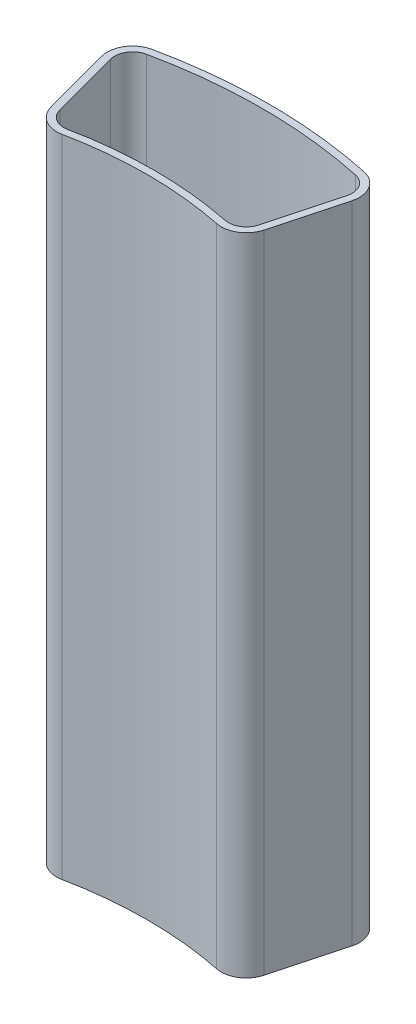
ISO-10303-21;
HEADER;
FILE_DESCRIPTION(('STEP AP214'),'2;1');
FILE_NAME('part.step','',(''),(''),'','','');
FILE_SCHEMA(('AUTOMOTIVE_DESIGN { 1 0 10303 214 1 1 1 1 }'));
ENDSEC;
DATA;
#1=APPLICATION_CONTEXT('core data for automotive mechanical design processes');
#2=APPLICATION_PROTOCOL_DEFINITION('international standard','automotive_design',2000,#1);
#3=PRODUCT_CONTEXT('',#1,'mechanical');
#4=PRODUCT('Part','Part','',(#3));
#5=PRODUCT_RELATED_PRODUCT_CATEGORY('part','',(#4));
#6=PRODUCT_DEFINITION_FORMATION('','',#4);
#7=PRODUCT_DEFINITION_CONTEXT('part definition',#1,'design');
#8=PRODUCT_DEFINITION('design','',#6,#7);
#9=PRODUCT_DEFINITION_SHAPE('','',#8);
#10=(LENGTH_UNIT() NAMED_UNIT(*) SI_UNIT(.MILLI.,.METRE.));
#11=(NAMED_UNIT(*) PLANE_ANGLE_UNIT() SI_UNIT($,.RADIAN.));
#12=(NAMED_UNIT(*) SI_UNIT($,.STERADIAN.) SOLID_ANGLE_UNIT());
#13=UNCERTAINTY_MEASURE_WITH_UNIT(LENGTH_MEASURE(1.E-05),#10,'distance_accuracy_value','');
#14=(GEOMETRIC_REPRESENTATION_CONTEXT(3) GLOBAL_UNCERTAINTY_ASSIGNED_CONTEXT((#13)) GLOBAL_UNIT_ASSIGNED_CONTEXT((#10,
#11,#12)) REPRESENTATION_CONTEXT('',''));
#15=CARTESIAN_POINT('',(0.,0.,0.));
#16=DIRECTION('',(0.,0.,1.));
#17=DIRECTION('',(1.,0.,0.));
#18=AXIS2_PLACEMENT_3D('',#15,#16,#17);
#19=CARTESIAN_POINT('',(0.,180.,0.));
#20=DIRECTION('',(0.,-1.,0.));
#21=DIRECTION('',(0.,0.,-1.));
#22=AXIS2_PLACEMENT_3D('',#19,#20,#21);
#23=CYLINDRICAL_SURFACE('',#22,108.);
#24=CARTESIAN_POINT('',(0.,180.,0.));
#25=DIRECTION('',(0.,-1.,0.));
#26=DIRECTION('',(0.,0.,1.));
#27=AXIS2_PLACEMENT_3D('',#24,#25,#26);
#28=CIRCLE('',#27,108.);
#29=CARTESIAN_POINT('',(-21.5507130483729,180.,-105.828005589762));
#30=VERTEX_POINT('',#29);
#31=CARTESIAN_POINT('',(21.5507130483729,180.,-105.828005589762));
#32=VERTEX_POINT('',#31);
#33=EDGE_CURVE('E205',#30,#32,#28,.T.);
#34=ORIENTED_EDGE('',*,*,#33,.F.);
#35=DIRECTION('',(0.,-1.,0.));
#36=VECTOR('',#35,1.);
#37=CARTESIAN_POINT('',(-21.5507130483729,180.,-105.828005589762));
#38=LINE('',#37,#36);
#39=CARTESIAN_POINT('',(-21.5507130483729,0.,-105.828005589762));
#40=VERTEX_POINT('',#39);
#41=EDGE_CURVE('E258',#30,#40,#38,.T.);
#42=ORIENTED_EDGE('',*,*,#41,.T.);
#43=CARTESIAN_POINT('',(0.,0.,0.));
#44=DIRECTION('',(0.,-1.,0.));
#45=DIRECTION('',(0.,0.,1.));
#46=AXIS2_PLACEMENT_3D('',#43,#44,#45);
#47=CIRCLE('',#46,108.);
#48=CARTESIAN_POINT('',(21.5507130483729,0.,-105.828005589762));
#49=VERTEX_POINT('',#48);
#50=EDGE_CURVE('E219',#40,#49,#47,.T.);
#51=ORIENTED_EDGE('',*,*,#50,.T.);
#52=DIRECTION('',(0.,-1.,0.));
#53=VECTOR('',#52,1.);
#54=CARTESIAN_POINT('',(21.5507130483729,180.,-105.828005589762));
#55=LINE('',#54,#53);
#56=EDGE_CURVE('E256',#49,#32,#55,.F.);
#57=ORIENTED_EDGE('',*,*,#56,.T.);
#58=EDGE_LOOP('',(#34,#42,#51,#57));
#59=FACE_BOUND('',#58,.T.);
#60=ADVANCED_FACE('F34',(#59),#23,.F.);
#61=CARTESIAN_POINT('',(27.9524568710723,180.,-104.319989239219));
#62=DIRECTION('',(-0.965925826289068,0.,-0.258819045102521));
#63=DIRECTION('',(-0.258819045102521,0.,0.965925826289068));
#64=AXIS2_PLACEMENT_3D('',#61,#62,#63);
#65=PLANE('',#64);
#66=DIRECTION('',(0.258819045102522,0.,-0.965925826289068));
#67=VECTOR('',#66,1.);
#68=CARTESIAN_POINT('',(27.9524568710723,0.,-104.319989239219));
#69=LINE('',#68,#67);
#70=CARTESIAN_POINT('',(29.7089993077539,0.,-110.875494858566));
#71=VERTEX_POINT('',#70);
#72=CARTESIAN_POINT('',(34.8935686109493,0.,-130.224570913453));
#73=VERTEX_POINT('',#72);
#74=EDGE_CURVE('E222',#71,#73,#69,.T.);
#75=ORIENTED_EDGE('',*,*,#74,.T.);
#76=DIRECTION('',(0.,-1.,0.));
#77=VECTOR('',#76,1.);
#78=CARTESIAN_POINT('',(34.8935686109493,180.,-130.224570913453));
#79=LINE('',#78,#77);
#80=CARTESIAN_POINT('',(34.8935686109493,180.,-130.224570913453));
#81=VERTEX_POINT('',#80);
#82=EDGE_CURVE('E11',#73,#81,#79,.F.);
#83=ORIENTED_EDGE('',*,*,#82,.T.);
#84=DIRECTION('',(0.258819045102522,0.,-0.965925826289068));
#85=VECTOR('',#84,1.);
#86=CARTESIAN_POINT('',(27.9524568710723,180.,-104.319989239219));
#87=LINE('',#86,#85);
#88=CARTESIAN_POINT('',(29.7089993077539,180.,-110.875494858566));
#89=VERTEX_POINT('',#88);
#90=EDGE_CURVE('E208',#89,#81,#87,.T.);
#91=ORIENTED_EDGE('',*,*,#90,.F.);
#92=DIRECTION('',(0.,-1.,0.));
#93=VECTOR('',#92,1.);
#94=CARTESIAN_POINT('',(29.7089993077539,180.,-110.875494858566));
#95=LINE('',#94,#93);
#96=EDGE_CURVE('E42',#89,#71,#95,.T.);
#97=ORIENTED_EDGE('',*,*,#96,.T.);
#98=EDGE_LOOP('',(#75,#83,#91,#97));
#99=FACE_BOUND('',#98,.T.);
#100=ADVANCED_FACE('F265',(#99),#65,.F.);
#101=CARTESIAN_POINT('',(0.,180.,0.));
#102=DIRECTION('',(0.,-1.,0.));
#103=DIRECTION('',(0.,0.,-1.));
#104=AXIS2_PLACEMENT_3D('',#101,#102,#103);
#105=CYLINDRICAL_SURFACE('',#104,142.);
#106=CARTESIAN_POINT('',(0.,0.,0.));
#107=DIRECTION('',(0.,1.,0.));
#108=DIRECTION('',(0.,0.,1.));
#109=AXIS2_PLACEMENT_3D('',#106,#107,#108);
#110=CIRCLE('',#109,142.);
#111=CARTESIAN_POINT('',(29.5907886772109,0.,-138.882631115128));
#112=VERTEX_POINT('',#111);
#113=CARTESIAN_POINT('',(-29.5907886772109,0.,-138.882631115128));
#114=VERTEX_POINT('',#113);
#115=EDGE_CURVE('E226',#112,#114,#110,.T.);
#116=ORIENTED_EDGE('',*,*,#115,.T.);
#117=DIRECTION('',(0.,-1.,0.));
#118=VECTOR('',#117,1.);
#119=CARTESIAN_POINT('',(-29.5907886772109,180.,-138.882631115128));
#120=LINE('',#119,#118);
#121=CARTESIAN_POINT('',(-29.5907886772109,180.,-138.882631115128));
#122=VERTEX_POINT('',#121);
#123=EDGE_CURVE('E246',#114,#122,#120,.F.);
#124=ORIENTED_EDGE('',*,*,#123,.T.);
#125=CARTESIAN_POINT('',(0.,180.,0.));
#126=DIRECTION('',(0.,1.,0.));
#127=DIRECTION('',(0.,0.,1.));
#128=AXIS2_PLACEMENT_3D('',#125,#126,#127);
#129=CIRCLE('',#128,142.);
#130=CARTESIAN_POINT('',(29.5907886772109,180.,-138.882631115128));
#131=VERTEX_POINT('',#130);
#132=EDGE_CURVE('E212',#131,#122,#129,.T.);
#133=ORIENTED_EDGE('',*,*,#132,.F.);
#134=DIRECTION('',(0.,-1.,0.));
#135=VECTOR('',#134,1.);
#136=CARTESIAN_POINT('',(29.5907886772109,180.,-138.882631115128));
#137=LINE('',#136,#135);
#138=EDGE_CURVE('E243',#131,#112,#137,.T.);
#139=ORIENTED_EDGE('',*,*,#138,.T.);
#140=EDGE_LOOP('',(#116,#124,#133,#139));
#141=FACE_BOUND('',#140,.T.);
#142=ADVANCED_FACE('F280',(#141),#105,.T.);
#143=CARTESIAN_POINT('',(-27.9524568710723,180.,-104.319989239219));
#144=DIRECTION('',(0.965925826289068,0.,-0.258819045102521));
#145=DIRECTION('',(-0.258819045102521,0.,-0.965925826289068));
#146=AXIS2_PLACEMENT_3D('',#143,#144,#145);
#147=PLANE('',#146);
#148=DIRECTION('',(0.258819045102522,0.,0.965925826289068));
#149=VECTOR('',#148,1.);
#150=CARTESIAN_POINT('',(-27.9524568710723,180.,-104.319989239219));
#151=LINE('',#150,#149);
#152=CARTESIAN_POINT('',(-34.8935686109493,180.,-130.224570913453));
#153=VERTEX_POINT('',#152);
#154=CARTESIAN_POINT('',(-29.7089993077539,180.,-110.875494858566));
#155=VERTEX_POINT('',#154);
#156=EDGE_CURVE('E215',#153,#155,#151,.T.);
#157=ORIENTED_EDGE('',*,*,#156,.F.);
#158=DIRECTION('',(0.,-1.,0.));
#159=VECTOR('',#158,1.);
#160=CARTESIAN_POINT('',(-34.8935686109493,180.,-130.224570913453));
#161=LINE('',#160,#159);
#162=CARTESIAN_POINT('',(-34.8935686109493,0.,-130.224570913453));
#163=VERTEX_POINT('',#162);
#164=EDGE_CURVE('E232',#153,#163,#161,.T.);
#165=ORIENTED_EDGE('',*,*,#164,.T.);
#166=DIRECTION('',(0.258819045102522,0.,0.965925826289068));
#167=VECTOR('',#166,1.);
#168=CARTESIAN_POINT('',(-27.9524568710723,0.,-104.319989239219));
#169=LINE('',#168,#167);
#170=CARTESIAN_POINT('',(-29.7089993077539,0.,-110.875494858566));
#171=VERTEX_POINT('',#170);
#172=EDGE_CURVE('E209',#163,#171,#169,.T.);
#173=ORIENTED_EDGE('',*,*,#172,.T.);
#174=DIRECTION('',(0.,-1.,0.));
#175=VECTOR('',#174,1.);
#176=CARTESIAN_POINT('',(-29.7089993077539,180.,-110.875494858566));
#177=LINE('',#176,#175);
#178=EDGE_CURVE('E218',#171,#155,#177,.F.);
#179=ORIENTED_EDGE('',*,*,#178,.T.);
#180=EDGE_LOOP('',(#157,#165,#173,#179));
#181=FACE_BOUND('',#180,.T.);
#182=ADVANCED_FACE('F288',(#181),#147,.F.);
#183=CARTESIAN_POINT('',(0.,180.,0.));
#184=DIRECTION('',(0.,1.,0.));
#185=DIRECTION('',(0.,0.,1.));
#186=AXIS2_PLACEMENT_3D('',#183,#184,#185);
#187=PLANE('',#186);
#188=CARTESIAN_POINT('',(0.,180.,0.));
#189=DIRECTION('',(0.,1.,0.));
#190=DIRECTION('',(0.,0.,1.));
#191=AXIS2_PLACEMENT_3D('',#188,#189,#190);
#192=CIRCLE('',#191,140.);
#193=CARTESIAN_POINT('',(29.1740170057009,180.,-136.92653771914));
#194=VERTEX_POINT('',#193);
#195=CARTESIAN_POINT('',(-29.1740170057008,180.,-136.92653771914));
#196=VERTEX_POINT('',#195);
#197=EDGE_CURVE('E178',#194,#196,#192,.T.);
#198=ORIENTED_EDGE('',*,*,#197,.F.);
#199=CARTESIAN_POINT('',(28.1320878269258,180.,-132.036304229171));
#200=DIRECTION('',(0.,1.,0.));
#201=DIRECTION('',(0.,0.,1.));
#202=AXIS2_PLACEMENT_3D('',#199,#200,#201);
#203=CIRCLE('',#202,5.);
#204=CARTESIAN_POINT('',(32.9617169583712,180.,-130.742209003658));
#205=VERTEX_POINT('',#204);
#206=EDGE_CURVE('E169',#205,#194,#203,.T.);
#207=ORIENTED_EDGE('',*,*,#206,.F.);
#208=DIRECTION('',(0.258819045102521,0.,-0.965925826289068));
#209=VECTOR('',#208,1.);
#210=CARTESIAN_POINT('',(26.0206052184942,180.,-104.837627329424));
#211=LINE('',#210,#209);
#212=CARTESIAN_POINT('',(27.7771476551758,180.,-111.393132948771));
#213=VERTEX_POINT('',#212);
#214=EDGE_CURVE('E49',#213,#205,#211,.T.);
#215=ORIENTED_EDGE('',*,*,#214,.F.);
#216=CARTESIAN_POINT('',(22.9475185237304,180.,-112.687228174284));
#217=DIRECTION('',(0.,1.,0.));
#218=DIRECTION('',(0.,0.,1.));
#219=AXIS2_PLACEMENT_3D('',#216,#217,#218);
#220=CIRCLE('',#219,5.);
#221=CARTESIAN_POINT('',(21.9498003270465,180.,-107.787783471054));
#222=VERTEX_POINT('',#221);
#223=EDGE_CURVE('E152',#222,#213,#220,.T.);
#224=ORIENTED_EDGE('',*,*,#223,.F.);
#225=CARTESIAN_POINT('',(0.,180.,0.));
#226=DIRECTION('',(0.,1.,0.));
#227=DIRECTION('',(0.,0.,1.));
#228=AXIS2_PLACEMENT_3D('',#225,#226,#227);
#229=CIRCLE('',#228,110.);
#230=CARTESIAN_POINT('',(-21.9498003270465,180.,-107.787783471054));
#231=VERTEX_POINT('',#230);
#232=EDGE_CURVE('E159',#231,#222,#229,.F.);
#233=ORIENTED_EDGE('',*,*,#232,.F.);
#234=CARTESIAN_POINT('',(-22.9475185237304,180.,-112.687228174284));
#235=DIRECTION('',(0.,1.,0.));
#236=DIRECTION('',(0.,0.,1.));
#237=AXIS2_PLACEMENT_3D('',#234,#235,#236);
#238=CIRCLE('',#237,5.);
#239=CARTESIAN_POINT('',(-27.7771476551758,180.,-111.393132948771));
#240=VERTEX_POINT('',#239);
#241=EDGE_CURVE('E172',#240,#231,#238,.T.);
#242=ORIENTED_EDGE('',*,*,#241,.F.);
#243=DIRECTION('',(0.258819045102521,0.,0.965925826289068));
#244=VECTOR('',#243,1.);
#245=CARTESIAN_POINT('',(-26.0206052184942,180.,-104.837627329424));
#246=LINE('',#245,#244);
#247=CARTESIAN_POINT('',(-32.9617169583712,180.,-130.742209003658));
#248=VERTEX_POINT('',#247);
#249=EDGE_CURVE('E182',#248,#240,#246,.T.);
#250=ORIENTED_EDGE('',*,*,#249,.F.);
#251=CARTESIAN_POINT('',(-28.1320878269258,180.,-132.036304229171));
#252=DIRECTION('',(0.,1.,0.));
#253=DIRECTION('',(0.,0.,1.));
#254=AXIS2_PLACEMENT_3D('',#251,#252,#253);
#255=CIRCLE('',#254,5.);
#256=EDGE_CURVE('E156',#196,#248,#255,.T.);
#257=ORIENTED_EDGE('',*,*,#256,.F.);
#258=EDGE_LOOP('',(#198,#207,#215,#224,#233,#242,#250,#257));
#259=FACE_BOUND('',#258,.T.);
#260=ORIENTED_EDGE('',*,*,#132,.T.);
#261=CARTESIAN_POINT('',(-28.1320878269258,180.,-132.036304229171));
#262=DIRECTION('',(0.,1.,0.));
#263=DIRECTION('',(0.,0.,1.));
#264=AXIS2_PLACEMENT_3D('',#261,#262,#263);
#265=CIRCLE('',#264,7.);
#266=EDGE_CURVE('E254',#122,#153,#265,.T.);
#267=ORIENTED_EDGE('',*,*,#266,.T.);
#268=ORIENTED_EDGE('',*,*,#156,.T.);
#269=CARTESIAN_POINT('',(-22.9475185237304,180.,-112.687228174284));
#270=DIRECTION('',(0.,1.,0.));
#271=DIRECTION('',(0.,0.,1.));
#272=AXIS2_PLACEMENT_3D('',#269,#270,#271);
#273=CIRCLE('',#272,7.);
#274=EDGE_CURVE('E252',#155,#30,#273,.T.);
#275=ORIENTED_EDGE('',*,*,#274,.T.);
#276=ORIENTED_EDGE('',*,*,#33,.T.);
#277=CARTESIAN_POINT('',(22.9475185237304,180.,-112.687228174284));
#278=DIRECTION('',(0.,1.,0.));
#279=DIRECTION('',(0.,0.,1.));
#280=AXIS2_PLACEMENT_3D('',#277,#278,#279);
#281=CIRCLE('',#280,7.);
#282=EDGE_CURVE('E248',#32,#89,#281,.T.);
#283=ORIENTED_EDGE('',*,*,#282,.T.);
#284=ORIENTED_EDGE('',*,*,#90,.T.);
#285=CARTESIAN_POINT('',(28.1320878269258,180.,-132.036304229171));
#286=DIRECTION('',(0.,1.,0.));
#287=DIRECTION('',(0.,0.,1.));
#288=AXIS2_PLACEMENT_3D('',#285,#286,#287);
#289=CIRCLE('',#288,7.);
#290=EDGE_CURVE('E250',#81,#131,#289,.T.);
#291=ORIENTED_EDGE('',*,*,#290,.T.);
#292=EDGE_LOOP('',(#260,#267,#268,#275,#276,#283,#284,#291));
#293=FACE_BOUND('',#292,.T.);
#294=ADVANCED_FACE('F166',(#259,#293),#187,.T.);
#295=CARTESIAN_POINT('',(0.,0.,0.));
#296=DIRECTION('',(0.,1.,0.));
#297=DIRECTION('',(0.,0.,1.));
#298=AXIS2_PLACEMENT_3D('',#295,#296,#297);
#299=PLANE('',#298);
#300=CARTESIAN_POINT('',(-28.1320878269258,0.,-132.036304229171));
#301=DIRECTION('',(0.,1.,0.));
#302=DIRECTION('',(0.,0.,1.));
#303=AXIS2_PLACEMENT_3D('',#300,#301,#302);
#304=CIRCLE('',#303,5.);
#305=CARTESIAN_POINT('',(-32.9617169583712,0.,-130.742209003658));
#306=VERTEX_POINT('',#305);
#307=CARTESIAN_POINT('',(-29.1740170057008,0.,-136.92653771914));
#308=VERTEX_POINT('',#307);
#309=EDGE_CURVE('E192',#306,#308,#304,.F.);
#310=ORIENTED_EDGE('',*,*,#309,.F.);
#311=DIRECTION('',(0.258819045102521,0.,0.965925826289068));
#312=VECTOR('',#311,1.);
#313=CARTESIAN_POINT('',(-26.0206052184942,0.,-104.837627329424));
#314=LINE('',#313,#312);
#315=CARTESIAN_POINT('',(-27.7771476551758,0.,-111.393132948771));
#316=VERTEX_POINT('',#315);
#317=EDGE_CURVE('E163',#306,#316,#314,.T.);
#318=ORIENTED_EDGE('',*,*,#317,.T.);
#319=CARTESIAN_POINT('',(-22.9475185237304,0.,-112.687228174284));
#320=DIRECTION('',(0.,1.,0.));
#321=DIRECTION('',(0.,0.,1.));
#322=AXIS2_PLACEMENT_3D('',#319,#320,#321);
#323=CIRCLE('',#322,5.);
#324=CARTESIAN_POINT('',(-21.9498003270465,0.,-107.787783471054));
#325=VERTEX_POINT('',#324);
#326=EDGE_CURVE('E190',#325,#316,#323,.F.);
#327=ORIENTED_EDGE('',*,*,#326,.F.);
#328=CARTESIAN_POINT('',(0.,0.,0.));
#329=DIRECTION('',(0.,1.,0.));
#330=DIRECTION('',(0.,0.,1.));
#331=AXIS2_PLACEMENT_3D('',#328,#329,#330);
#332=CIRCLE('',#331,110.);
#333=CARTESIAN_POINT('',(21.9498003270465,0.,-107.787783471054));
#334=VERTEX_POINT('',#333);
#335=EDGE_CURVE('E57',#325,#334,#332,.F.);
#336=ORIENTED_EDGE('',*,*,#335,.T.);
#337=CARTESIAN_POINT('',(22.9475185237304,0.,-112.687228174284));
#338=DIRECTION('',(0.,1.,0.));
#339=DIRECTION('',(0.,0.,1.));
#340=AXIS2_PLACEMENT_3D('',#337,#338,#339);
#341=CIRCLE('',#340,5.);
#342=CARTESIAN_POINT('',(27.7771476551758,0.,-111.393132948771));
#343=VERTEX_POINT('',#342);
#344=EDGE_CURVE('E154',#343,#334,#341,.F.);
#345=ORIENTED_EDGE('',*,*,#344,.F.);
#346=DIRECTION('',(0.258819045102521,0.,-0.965925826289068));
#347=VECTOR('',#346,1.);
#348=CARTESIAN_POINT('',(26.0206052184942,0.,-104.837627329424));
#349=LINE('',#348,#347);
#350=CARTESIAN_POINT('',(32.9617169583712,0.,-130.742209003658));
#351=VERTEX_POINT('',#350);
#352=EDGE_CURVE('E189',#343,#351,#349,.T.);
#353=ORIENTED_EDGE('',*,*,#352,.T.);
#354=CARTESIAN_POINT('',(28.1320878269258,0.,-132.036304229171));
#355=DIRECTION('',(0.,1.,0.));
#356=DIRECTION('',(0.,0.,1.));
#357=AXIS2_PLACEMENT_3D('',#354,#355,#356);
#358=CIRCLE('',#357,5.);
#359=CARTESIAN_POINT('',(29.1740170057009,0.,-136.92653771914));
#360=VERTEX_POINT('',#359);
#361=EDGE_CURVE('E193',#360,#351,#358,.F.);
#362=ORIENTED_EDGE('',*,*,#361,.F.);
#363=CARTESIAN_POINT('',(0.,0.,0.));
#364=DIRECTION('',(0.,1.,0.));
#365=DIRECTION('',(0.,0.,1.));
#366=AXIS2_PLACEMENT_3D('',#363,#364,#365);
#367=CIRCLE('',#366,140.);
#368=EDGE_CURVE('E196',#360,#308,#367,.T.);
#369=ORIENTED_EDGE('',*,*,#368,.T.);
#370=EDGE_LOOP('',(#310,#318,#327,#336,#345,#353,#362,#369));
#371=FACE_BOUND('',#370,.T.);
#372=ORIENTED_EDGE('',*,*,#172,.F.);
#373=CARTESIAN_POINT('',(-28.1320878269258,0.,-132.036304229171));
#374=DIRECTION('',(0.,1.,0.));
#375=DIRECTION('',(0.,0.,1.));
#376=AXIS2_PLACEMENT_3D('',#373,#374,#375);
#377=CIRCLE('',#376,7.);
#378=EDGE_CURVE('E241',#163,#114,#377,.F.);
#379=ORIENTED_EDGE('',*,*,#378,.T.);
#380=ORIENTED_EDGE('',*,*,#115,.F.);
#381=CARTESIAN_POINT('',(28.1320878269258,0.,-132.036304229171));
#382=DIRECTION('',(0.,1.,0.));
#383=DIRECTION('',(0.,0.,1.));
#384=AXIS2_PLACEMENT_3D('',#381,#382,#383);
#385=CIRCLE('',#384,7.);
#386=EDGE_CURVE('E237',#112,#73,#385,.F.);
#387=ORIENTED_EDGE('',*,*,#386,.T.);
#388=ORIENTED_EDGE('',*,*,#74,.F.);
#389=CARTESIAN_POINT('',(22.9475185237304,0.,-112.687228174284));
#390=DIRECTION('',(0.,1.,0.));
#391=DIRECTION('',(0.,0.,1.));
#392=AXIS2_PLACEMENT_3D('',#389,#390,#391);
#393=CIRCLE('',#392,7.);
#394=EDGE_CURVE('E235',#71,#49,#393,.F.);
#395=ORIENTED_EDGE('',*,*,#394,.T.);
#396=ORIENTED_EDGE('',*,*,#50,.F.);
#397=CARTESIAN_POINT('',(-22.9475185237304,0.,-112.687228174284));
#398=DIRECTION('',(0.,1.,0.));
#399=DIRECTION('',(0.,0.,1.));
#400=AXIS2_PLACEMENT_3D('',#397,#398,#399);
#401=CIRCLE('',#400,7.);
#402=EDGE_CURVE('E239',#40,#171,#401,.F.);
#403=ORIENTED_EDGE('',*,*,#402,.T.);
#404=EDGE_LOOP('',(#372,#379,#380,#387,#388,#395,#396,#403));
#405=FACE_BOUND('',#404,.T.);
#406=ADVANCED_FACE('F271',(#371,#405),#299,.F.);
#407=CARTESIAN_POINT('',(-28.1320878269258,180.,-132.036304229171));
#408=DIRECTION('',(0.,-1.,0.));
#409=DIRECTION('',(0.,0.,-1.));
#410=AXIS2_PLACEMENT_3D('',#407,#408,#409);
#411=CYLINDRICAL_SURFACE('',#410,7.);
#412=ORIENTED_EDGE('',*,*,#266,.F.);
#413=ORIENTED_EDGE('',*,*,#123,.F.);
#414=ORIENTED_EDGE('',*,*,#378,.F.);
#415=ORIENTED_EDGE('',*,*,#164,.F.);
#416=EDGE_LOOP('',(#412,#413,#414,#415));
#417=FACE_BOUND('',#416,.T.);
#418=ADVANCED_FACE('F286',(#417),#411,.T.);
#419=CARTESIAN_POINT('',(-22.9475185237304,180.,-112.687228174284));
#420=DIRECTION('',(0.,-1.,0.));
#421=DIRECTION('',(0.,0.,-1.));
#422=AXIS2_PLACEMENT_3D('',#419,#420,#421);
#423=CYLINDRICAL_SURFACE('',#422,7.);
#424=ORIENTED_EDGE('',*,*,#274,.F.);
#425=ORIENTED_EDGE('',*,*,#178,.F.);
#426=ORIENTED_EDGE('',*,*,#402,.F.);
#427=ORIENTED_EDGE('',*,*,#41,.F.);
#428=EDGE_LOOP('',(#424,#425,#426,#427));
#429=FACE_BOUND('',#428,.T.);
#430=ADVANCED_FACE('F293',(#429),#423,.T.);
#431=CARTESIAN_POINT('',(28.1320878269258,180.,-132.036304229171));
#432=DIRECTION('',(0.,-1.,0.));
#433=DIRECTION('',(0.,0.,-1.));
#434=AXIS2_PLACEMENT_3D('',#431,#432,#433);
#435=CYLINDRICAL_SURFACE('',#434,7.);
#436=ORIENTED_EDGE('',*,*,#290,.F.);
#437=ORIENTED_EDGE('',*,*,#82,.F.);
#438=ORIENTED_EDGE('',*,*,#386,.F.);
#439=ORIENTED_EDGE('',*,*,#138,.F.);
#440=EDGE_LOOP('',(#436,#437,#438,#439));
#441=FACE_BOUND('',#440,.T.);
#442=ADVANCED_FACE('F277',(#441),#435,.T.);
#443=CARTESIAN_POINT('',(22.9475185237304,180.,-112.687228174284));
#444=DIRECTION('',(0.,-1.,0.));
#445=DIRECTION('',(0.,0.,-1.));
#446=AXIS2_PLACEMENT_3D('',#443,#444,#445);
#447=CYLINDRICAL_SURFACE('',#446,7.);
#448=ORIENTED_EDGE('',*,*,#282,.F.);
#449=ORIENTED_EDGE('',*,*,#56,.F.);
#450=ORIENTED_EDGE('',*,*,#394,.F.);
#451=ORIENTED_EDGE('',*,*,#96,.F.);
#452=EDGE_LOOP('',(#448,#449,#450,#451));
#453=FACE_BOUND('',#452,.T.);
#454=ADVANCED_FACE('F36',(#453),#447,.T.);
#455=CARTESIAN_POINT('',(0.,180.,0.));
#456=DIRECTION('',(0.,-1.,0.));
#457=DIRECTION('',(0.,0.,-1.));
#458=AXIS2_PLACEMENT_3D('',#455,#456,#457);
#459=CYLINDRICAL_SURFACE('',#458,110.);
#460=ORIENTED_EDGE('',*,*,#232,.T.);
#461=DIRECTION('',(0.,-1.,0.));
#462=VECTOR('',#461,1.);
#463=CARTESIAN_POINT('',(21.9498003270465,180.,-107.787783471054));
#464=LINE('',#463,#462);
#465=EDGE_CURVE('E148',#334,#222,#464,.F.);
#466=ORIENTED_EDGE('',*,*,#465,.F.);
#467=ORIENTED_EDGE('',*,*,#335,.F.);
#468=DIRECTION('',(0.,-1.,0.));
#469=VECTOR('',#468,1.);
#470=CARTESIAN_POINT('',(-21.9498003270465,180.,-107.787783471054));
#471=LINE('',#470,#469);
#472=EDGE_CURVE('E155',#231,#325,#471,.T.);
#473=ORIENTED_EDGE('',*,*,#472,.F.);
#474=EDGE_LOOP('',(#460,#466,#467,#473));
#475=FACE_BOUND('',#474,.T.);
#476=ADVANCED_FACE('F160',(#475),#459,.T.);
#477=CARTESIAN_POINT('',(26.0206052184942,180.,-104.837627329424));
#478=DIRECTION('',(-0.965925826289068,0.,-0.258819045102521));
#479=DIRECTION('',(-0.258819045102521,0.,0.965925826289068));
#480=AXIS2_PLACEMENT_3D('',#477,#478,#479);
#481=PLANE('',#480);
#482=ORIENTED_EDGE('',*,*,#352,.F.);
#483=DIRECTION('',(0.,1.,0.));
#484=VECTOR('',#483,1.);
#485=CARTESIAN_POINT('',(27.7771476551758,180.,-111.393132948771));
#486=LINE('',#485,#484);
#487=EDGE_CURVE('E465',#213,#343,#486,.F.);
#488=ORIENTED_EDGE('',*,*,#487,.F.);
#489=ORIENTED_EDGE('',*,*,#214,.T.);
#490=DIRECTION('',(0.,1.,0.));
#491=VECTOR('',#490,1.);
#492=CARTESIAN_POINT('',(32.9617169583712,180.,-130.742209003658));
#493=LINE('',#492,#491);
#494=EDGE_CURVE('E223',#351,#205,#493,.T.);
#495=ORIENTED_EDGE('',*,*,#494,.F.);
#496=EDGE_LOOP('',(#482,#488,#489,#495));
#497=FACE_BOUND('',#496,.T.);
#498=ADVANCED_FACE('F302',(#497),#481,.T.);
#499=CARTESIAN_POINT('',(0.,180.,0.));
#500=DIRECTION('',(0.,-1.,0.));
#501=DIRECTION('',(0.,0.,-1.));
#502=AXIS2_PLACEMENT_3D('',#499,#500,#501);
#503=CYLINDRICAL_SURFACE('',#502,140.);
#504=ORIENTED_EDGE('',*,*,#368,.F.);
#505=DIRECTION('',(0.,-1.,0.));
#506=VECTOR('',#505,1.);
#507=CARTESIAN_POINT('',(29.1740170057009,180.,-136.92653771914));
#508=LINE('',#507,#506);
#509=EDGE_CURVE('E174',#194,#360,#508,.T.);
#510=ORIENTED_EDGE('',*,*,#509,.F.);
#511=ORIENTED_EDGE('',*,*,#197,.T.);
#512=DIRECTION('',(0.,-1.,0.));
#513=VECTOR('',#512,1.);
#514=CARTESIAN_POINT('',(-29.1740170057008,180.,-136.92653771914));
#515=LINE('',#514,#513);
#516=EDGE_CURVE('E170',#308,#196,#515,.F.);
#517=ORIENTED_EDGE('',*,*,#516,.F.);
#518=EDGE_LOOP('',(#504,#510,#511,#517));
#519=FACE_BOUND('',#518,.T.);
#520=ADVANCED_FACE('F362',(#519),#503,.F.);
#521=CARTESIAN_POINT('',(-26.0206052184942,180.,-104.837627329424));
#522=DIRECTION('',(0.965925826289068,0.,-0.258819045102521));
#523=DIRECTION('',(-0.258819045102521,0.,-0.965925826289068));
#524=AXIS2_PLACEMENT_3D('',#521,#522,#523);
#525=PLANE('',#524);
#526=ORIENTED_EDGE('',*,*,#249,.T.);
#527=DIRECTION('',(0.,1.,0.));
#528=VECTOR('',#527,1.);
#529=CARTESIAN_POINT('',(-27.7771476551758,180.,-111.393132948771));
#530=LINE('',#529,#528);
#531=EDGE_CURVE('E186',#316,#240,#530,.T.);
#532=ORIENTED_EDGE('',*,*,#531,.F.);
#533=ORIENTED_EDGE('',*,*,#317,.F.);
#534=DIRECTION('',(0.,1.,0.));
#535=VECTOR('',#534,1.);
#536=CARTESIAN_POINT('',(-32.9617169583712,180.,-130.742209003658));
#537=LINE('',#536,#535);
#538=EDGE_CURVE('E204',#248,#306,#537,.F.);
#539=ORIENTED_EDGE('',*,*,#538,.F.);
#540=EDGE_LOOP('',(#526,#532,#533,#539));
#541=FACE_BOUND('',#540,.T.);
#542=ADVANCED_FACE('F371',(#541),#525,.T.);
#543=CARTESIAN_POINT('',(-28.1320878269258,180.,-132.036304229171));
#544=DIRECTION('',(0.,-1.,0.));
#545=DIRECTION('',(0.,0.,-1.));
#546=AXIS2_PLACEMENT_3D('',#543,#544,#545);
#547=CYLINDRICAL_SURFACE('',#546,5.);
#548=ORIENTED_EDGE('',*,*,#256,.T.);
#549=ORIENTED_EDGE('',*,*,#538,.T.);
#550=ORIENTED_EDGE('',*,*,#309,.T.);
#551=ORIENTED_EDGE('',*,*,#516,.T.);
#552=EDGE_LOOP('',(#548,#549,#550,#551));
#553=FACE_BOUND('',#552,.T.);
#554=ADVANCED_FACE('F381',(#553),#547,.F.);
#555=CARTESIAN_POINT('',(-22.9475185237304,180.,-112.687228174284));
#556=DIRECTION('',(0.,-1.,0.));
#557=DIRECTION('',(0.,0.,-1.));
#558=AXIS2_PLACEMENT_3D('',#555,#556,#557);
#559=CYLINDRICAL_SURFACE('',#558,5.);
#560=ORIENTED_EDGE('',*,*,#241,.T.);
#561=ORIENTED_EDGE('',*,*,#472,.T.);
#562=ORIENTED_EDGE('',*,*,#326,.T.);
#563=ORIENTED_EDGE('',*,*,#531,.T.);
#564=EDGE_LOOP('',(#560,#561,#562,#563));
#565=FACE_BOUND('',#564,.T.);
#566=ADVANCED_FACE('F391',(#565),#559,.F.);
#567=CARTESIAN_POINT('',(28.1320878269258,180.,-132.036304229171));
#568=DIRECTION('',(0.,-1.,0.));
#569=DIRECTION('',(0.,0.,-1.));
#570=AXIS2_PLACEMENT_3D('',#567,#568,#569);
#571=CYLINDRICAL_SURFACE('',#570,5.);
#572=ORIENTED_EDGE('',*,*,#206,.T.);
#573=ORIENTED_EDGE('',*,*,#509,.T.);
#574=ORIENTED_EDGE('',*,*,#361,.T.);
#575=ORIENTED_EDGE('',*,*,#494,.T.);
#576=EDGE_LOOP('',(#572,#573,#574,#575));
#577=FACE_BOUND('',#576,.T.);
#578=ADVANCED_FACE('F401',(#577),#571,.F.);
#579=CARTESIAN_POINT('',(22.9475185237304,180.,-112.687228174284));
#580=DIRECTION('',(0.,-1.,0.));
#581=DIRECTION('',(0.,0.,-1.));
#582=AXIS2_PLACEMENT_3D('',#579,#580,#581);
#583=CYLINDRICAL_SURFACE('',#582,5.);
#584=ORIENTED_EDGE('',*,*,#223,.T.);
#585=ORIENTED_EDGE('',*,*,#487,.T.);
#586=ORIENTED_EDGE('',*,*,#344,.T.);
#587=ORIENTED_EDGE('',*,*,#465,.T.);
#588=EDGE_LOOP('',(#584,#585,#586,#587));
#589=FACE_BOUND('',#588,.T.);
#590=ADVANCED_FACE('F150',(#589),#583,.F.);
#591=CLOSED_SHELL('',(#60,#100,#142,#182,#294,#406,#418,#430,#442,#454,#476,#498,#520,#542,#554,
#566,#578,#590));
#592=MANIFOLD_SOLID_BREP('B2',#591);
#593=ADVANCED_BREP_SHAPE_REPRESENTATION('',(#18,#592),#14);
#594=SHAPE_DEFINITION_REPRESENTATION(#9,#593);
ENDSEC;
END-ISO-10303-21;
